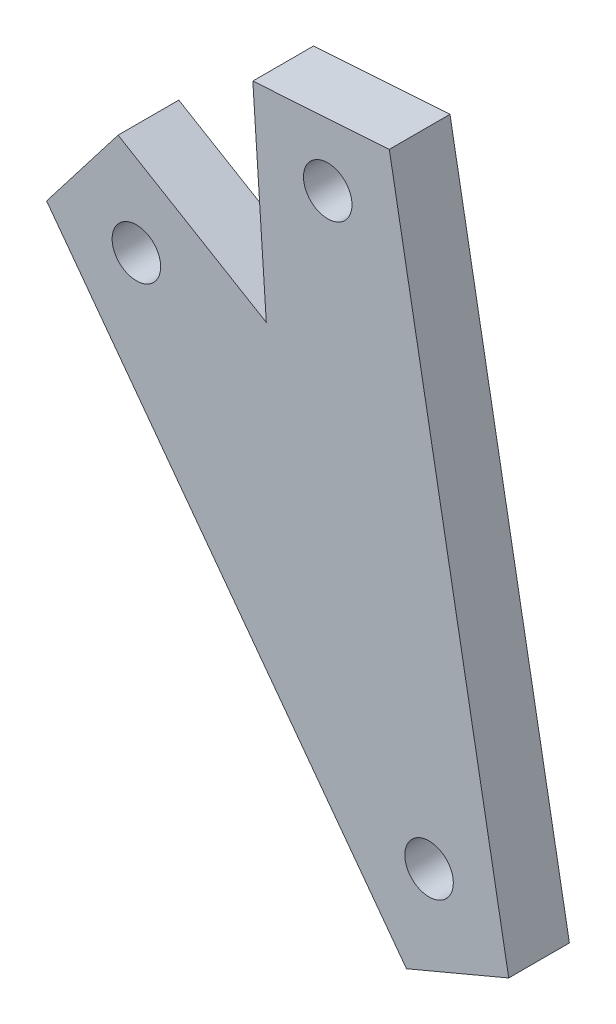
ISO-10303-21;
HEADER;
FILE_DESCRIPTION(('STEP AP214'),'2;1');
FILE_NAME('part.step','',(''),(''),'','','');
FILE_SCHEMA(('AUTOMOTIVE_DESIGN { 1 0 10303 214 1 1 1 1 }'));
ENDSEC;
DATA;
#1=APPLICATION_CONTEXT('core data for automotive mechanical design processes');
#2=APPLICATION_PROTOCOL_DEFINITION('international standard','automotive_design',2000,#1);
#3=PRODUCT_CONTEXT('',#1,'mechanical');
#4=PRODUCT('Part','Part','',(#3));
#5=PRODUCT_RELATED_PRODUCT_CATEGORY('part','',(#4));
#6=PRODUCT_DEFINITION_FORMATION('','',#4);
#7=PRODUCT_DEFINITION_CONTEXT('part definition',#1,'design');
#8=PRODUCT_DEFINITION('design','',#6,#7);
#9=PRODUCT_DEFINITION_SHAPE('','',#8);
#10=(LENGTH_UNIT() NAMED_UNIT(*) SI_UNIT(.MILLI.,.METRE.));
#11=(NAMED_UNIT(*) PLANE_ANGLE_UNIT() SI_UNIT($,.RADIAN.));
#12=(NAMED_UNIT(*) SI_UNIT($,.STERADIAN.) SOLID_ANGLE_UNIT());
#13=UNCERTAINTY_MEASURE_WITH_UNIT(LENGTH_MEASURE(1.E-05),#10,'distance_accuracy_value','');
#14=(GEOMETRIC_REPRESENTATION_CONTEXT(3) GLOBAL_UNCERTAINTY_ASSIGNED_CONTEXT((#13)) GLOBAL_UNIT_ASSIGNED_CONTEXT((#10,
#11,#12)) REPRESENTATION_CONTEXT('',''));
#15=CARTESIAN_POINT('',(0.,0.,0.));
#16=DIRECTION('',(0.,0.,1.));
#17=DIRECTION('',(1.,0.,0.));
#18=AXIS2_PLACEMENT_3D('',#15,#16,#17);
#19=CARTESIAN_POINT('',(0.,0.,6.35));
#20=DIRECTION('',(0.,0.,-1.));
#21=DIRECTION('',(-1.,0.,0.));
#22=AXIS2_PLACEMENT_3D('',#19,#20,#21);
#23=PLANE('',#22);
#24=CARTESIAN_POINT('',(-30.6283624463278,40.5283038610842,6.35));
#25=DIRECTION('',(0.,0.,1.));
#26=DIRECTION('',(1.,0.,0.));
#27=AXIS2_PLACEMENT_3D('',#24,#25,#26);
#28=CIRCLE('',#27,2.54);
#29=CARTESIAN_POINT('',(-28.0883624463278,40.5283038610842,6.35));
#30=VERTEX_POINT('',#29);
#31=EDGE_CURVE('E164',#30,#30,#28,.T.);
#32=ORIENTED_EDGE('',*,*,#31,.F.);
#33=EDGE_LOOP('',(#32));
#34=FACE_BOUND('',#33,.T.);
#35=DIRECTION('',(-0.610620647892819,-0.791923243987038,0.));
#36=VECTOR('',#35,1.);
#37=CARTESIAN_POINT('',(-32.5418459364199,50.234477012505,6.35));
#38=LINE('',#37,#36);
#39=CARTESIAN_POINT('',(-32.5418459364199,50.234477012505,6.35));
#40=VERTEX_POINT('',#39);
#41=CARTESIAN_POINT('',(-40.0258916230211,40.5283038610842,6.35));
#42=VERTEX_POINT('',#41);
#43=EDGE_CURVE('E137',#40,#42,#38,.T.);
#44=ORIENTED_EDGE('',*,*,#43,.T.);
#45=DIRECTION('',(0.595876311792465,-0.803076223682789,0.));
#46=VECTOR('',#45,1.);
#47=CARTESIAN_POINT('',(-40.0258916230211,40.5283038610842,6.35));
#48=LINE('',#47,#46);
#49=CARTESIAN_POINT('',(-2.36193193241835,-10.2322817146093,6.35));
#50=VERTEX_POINT('',#49);
#51=EDGE_CURVE('E90',#42,#50,#48,.T.);
#52=ORIENTED_EDGE('',*,*,#51,.T.);
#53=DIRECTION('',(0.921374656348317,0.388675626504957,0.));
#54=VECTOR('',#53,1.);
#55=CARTESIAN_POINT('',(-2.36193193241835,-10.2322817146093,6.35));
#56=LINE('',#55,#54);
#57=CARTESIAN_POINT('',(8.33836303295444,-5.71843512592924,6.35));
#58=VERTEX_POINT('',#57);
#59=EDGE_CURVE('E149',#50,#58,#56,.T.);
#60=ORIENTED_EDGE('',*,*,#59,.T.);
#61=DIRECTION('',(-0.178582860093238,0.983924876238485,0.));
#62=VECTOR('',#61,1.);
#63=CARTESIAN_POINT('',(8.33836303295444,-5.71843512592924,6.35));
#64=LINE('',#63,#62);
#65=CARTESIAN_POINT('',(-4.1590904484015,63.1378670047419,6.35));
#66=VERTEX_POINT('',#65);
#67=EDGE_CURVE('E106',#58,#66,#64,.T.);
#68=ORIENTED_EDGE('',*,*,#67,.T.);
#69=DIRECTION('',(-0.997791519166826,-0.0664235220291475,0.));
#70=VECTOR('',#69,1.);
#71=CARTESIAN_POINT('',(-4.1590904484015,63.1378670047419,6.35));
#72=LINE('',#71,#70);
#73=CARTESIAN_POINT('',(-18.442322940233,62.1870244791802,6.35));
#74=VERTEX_POINT('',#73);
#75=EDGE_CURVE('E100',#66,#74,#72,.T.);
#76=ORIENTED_EDGE('',*,*,#75,.T.);
#77=DIRECTION('',(0.0664235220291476,-0.997791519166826,0.));
#78=VECTOR('',#77,1.);
#79=CARTESIAN_POINT('',(-18.442322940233,62.1870244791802,6.35));
#80=LINE('',#79,#78);
#81=CARTESIAN_POINT('',(-17.0326458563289,41.0113355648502,6.35));
#82=VERTEX_POINT('',#81);
#83=EDGE_CURVE('E104',#74,#82,#80,.T.);
#84=ORIENTED_EDGE('',*,*,#83,.T.);
#85=DIRECTION('',(-0.859500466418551,0.511134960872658,0.));
#86=VECTOR('',#85,1.);
#87=CARTESIAN_POINT('',(-17.0326458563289,41.0113355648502,6.35));
#88=LINE('',#87,#86);
#89=EDGE_CURVE('E50',#82,#40,#88,.T.);
#90=ORIENTED_EDGE('',*,*,#89,.T.);
#91=EDGE_LOOP('',(#44,#52,#60,#68,#76,#84,#90));
#92=FACE_BOUND('',#91,.T.);
#93=CARTESIAN_POINT('',(-10.6059683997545,56.1572429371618,6.35));
#94=DIRECTION('',(0.,0.,1.));
#95=DIRECTION('',(1.,0.,0.));
#96=AXIS2_PLACEMENT_3D('',#93,#94,#95);
#97=CIRCLE('',#96,2.54);
#98=CARTESIAN_POINT('',(-8.06596839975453,56.1572429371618,6.35));
#99=VERTEX_POINT('',#98);
#100=EDGE_CURVE('E128',#99,#99,#97,.T.);
#101=ORIENTED_EDGE('',*,*,#100,.F.);
#102=EDGE_LOOP('',(#101));
#103=FACE_BOUND('',#102,.T.);
#104=CARTESIAN_POINT('',(0.,0.,6.35));
#105=DIRECTION('',(0.,0.,1.));
#106=DIRECTION('',(1.,0.,0.));
#107=AXIS2_PLACEMENT_3D('',#104,#105,#106);
#108=CIRCLE('',#107,2.54);
#109=CARTESIAN_POINT('',(2.54,0.,6.35));
#110=VERTEX_POINT('',#109);
#111=EDGE_CURVE('E170',#110,#110,#108,.T.);
#112=ORIENTED_EDGE('',*,*,#111,.F.);
#113=EDGE_LOOP('',(#112));
#114=FACE_BOUND('',#113,.T.);
#115=ADVANCED_FACE('F33',(#34,#92,#103,#114),#23,.F.);
#116=CARTESIAN_POINT('',(0.,0.,0.));
#117=DIRECTION('',(0.,0.,-1.));
#118=DIRECTION('',(-1.,0.,0.));
#119=AXIS2_PLACEMENT_3D('',#116,#117,#118);
#120=PLANE('',#119);
#121=CARTESIAN_POINT('',(-30.6283624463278,40.5283038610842,0.));
#122=DIRECTION('',(0.,0.,1.));
#123=DIRECTION('',(1.,0.,0.));
#124=AXIS2_PLACEMENT_3D('',#121,#122,#123);
#125=CIRCLE('',#124,2.54);
#126=CARTESIAN_POINT('',(-28.0883624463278,40.5283038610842,0.));
#127=VERTEX_POINT('',#126);
#128=EDGE_CURVE('E167',#127,#127,#125,.T.);
#129=ORIENTED_EDGE('',*,*,#128,.T.);
#130=EDGE_LOOP('',(#129));
#131=FACE_BOUND('',#130,.T.);
#132=DIRECTION('',(-0.610620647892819,-0.791923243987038,0.));
#133=VECTOR('',#132,1.);
#134=CARTESIAN_POINT('',(-32.5418459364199,50.234477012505,0.));
#135=LINE('',#134,#133);
#136=CARTESIAN_POINT('',(-32.5418459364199,50.234477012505,0.));
#137=VERTEX_POINT('',#136);
#138=CARTESIAN_POINT('',(-40.0258916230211,40.5283038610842,0.));
#139=VERTEX_POINT('',#138);
#140=EDGE_CURVE('E124',#137,#139,#135,.T.);
#141=ORIENTED_EDGE('',*,*,#140,.F.);
#142=DIRECTION('',(-0.859500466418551,0.511134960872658,0.));
#143=VECTOR('',#142,1.);
#144=CARTESIAN_POINT('',(-17.0326458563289,41.0113355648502,0.));
#145=LINE('',#144,#143);
#146=CARTESIAN_POINT('',(-17.0326458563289,41.0113355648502,0.));
#147=VERTEX_POINT('',#146);
#148=EDGE_CURVE('E82',#147,#137,#145,.T.);
#149=ORIENTED_EDGE('',*,*,#148,.F.);
#150=DIRECTION('',(0.0664235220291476,-0.997791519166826,0.));
#151=VECTOR('',#150,1.);
#152=CARTESIAN_POINT('',(-18.442322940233,62.1870244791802,0.));
#153=LINE('',#152,#151);
#154=CARTESIAN_POINT('',(-18.442322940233,62.1870244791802,0.));
#155=VERTEX_POINT('',#154);
#156=EDGE_CURVE('E76',#155,#147,#153,.T.);
#157=ORIENTED_EDGE('',*,*,#156,.F.);
#158=DIRECTION('',(-0.997791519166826,-0.0664235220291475,0.));
#159=VECTOR('',#158,1.);
#160=CARTESIAN_POINT('',(-4.1590904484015,63.1378670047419,0.));
#161=LINE('',#160,#159);
#162=CARTESIAN_POINT('',(-4.1590904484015,63.1378670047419,0.));
#163=VERTEX_POINT('',#162);
#164=EDGE_CURVE('E114',#163,#155,#161,.T.);
#165=ORIENTED_EDGE('',*,*,#164,.F.);
#166=DIRECTION('',(-0.178582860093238,0.983924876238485,0.));
#167=VECTOR('',#166,1.);
#168=CARTESIAN_POINT('',(8.33836303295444,-5.71843512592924,0.));
#169=LINE('',#168,#167);
#170=CARTESIAN_POINT('',(8.33836303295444,-5.71843512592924,0.));
#171=VERTEX_POINT('',#170);
#172=EDGE_CURVE('E132',#171,#163,#169,.T.);
#173=ORIENTED_EDGE('',*,*,#172,.F.);
#174=DIRECTION('',(0.921374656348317,0.388675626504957,0.));
#175=VECTOR('',#174,1.);
#176=CARTESIAN_POINT('',(-2.36193193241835,-10.2322817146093,0.));
#177=LINE('',#176,#175);
#178=CARTESIAN_POINT('',(-2.36193193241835,-10.2322817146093,0.));
#179=VERTEX_POINT('',#178);
#180=EDGE_CURVE('E130',#179,#171,#177,.T.);
#181=ORIENTED_EDGE('',*,*,#180,.F.);
#182=DIRECTION('',(0.595876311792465,-0.803076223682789,0.));
#183=VECTOR('',#182,1.);
#184=CARTESIAN_POINT('',(-40.0258916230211,40.5283038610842,0.));
#185=LINE('',#184,#183);
#186=EDGE_CURVE('E127',#139,#179,#185,.T.);
#187=ORIENTED_EDGE('',*,*,#186,.F.);
#188=EDGE_LOOP('',(#141,#149,#157,#165,#173,#181,#187));
#189=FACE_BOUND('',#188,.T.);
#190=CARTESIAN_POINT('',(-10.6059683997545,56.1572429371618,0.));
#191=DIRECTION('',(0.,0.,1.));
#192=DIRECTION('',(1.,0.,0.));
#193=AXIS2_PLACEMENT_3D('',#190,#191,#192);
#194=CIRCLE('',#193,2.54);
#195=CARTESIAN_POINT('',(-8.06596839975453,56.1572429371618,0.));
#196=VERTEX_POINT('',#195);
#197=EDGE_CURVE('E161',#196,#196,#194,.T.);
#198=ORIENTED_EDGE('',*,*,#197,.T.);
#199=EDGE_LOOP('',(#198));
#200=FACE_BOUND('',#199,.T.);
#201=CARTESIAN_POINT('',(0.,0.,0.));
#202=DIRECTION('',(0.,0.,1.));
#203=DIRECTION('',(1.,0.,0.));
#204=AXIS2_PLACEMENT_3D('',#201,#202,#203);
#205=CIRCLE('',#204,2.54);
#206=CARTESIAN_POINT('',(2.54,0.,0.));
#207=VERTEX_POINT('',#206);
#208=EDGE_CURVE('E173',#207,#207,#205,.T.);
#209=ORIENTED_EDGE('',*,*,#208,.T.);
#210=EDGE_LOOP('',(#209));
#211=FACE_BOUND('',#210,.T.);
#212=ADVANCED_FACE('F153',(#131,#189,#200,#211),#120,.T.);
#213=CARTESIAN_POINT('',(-32.5418459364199,50.234477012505,6.35));
#214=DIRECTION('',(0.791923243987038,-0.610620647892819,0.));
#215=DIRECTION('',(0.610620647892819,0.791923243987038,0.));
#216=AXIS2_PLACEMENT_3D('',#213,#214,#215);
#217=PLANE('',#216);
#218=ORIENTED_EDGE('',*,*,#140,.T.);
#219=DIRECTION('',(0.,0.,-1.));
#220=VECTOR('',#219,1.);
#221=CARTESIAN_POINT('',(-40.0258916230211,40.5283038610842,6.35));
#222=LINE('',#221,#220);
#223=EDGE_CURVE('E11',#42,#139,#222,.T.);
#224=ORIENTED_EDGE('',*,*,#223,.F.);
#225=ORIENTED_EDGE('',*,*,#43,.F.);
#226=DIRECTION('',(0.,0.,-1.));
#227=VECTOR('',#226,1.);
#228=CARTESIAN_POINT('',(-32.5418459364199,50.234477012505,6.35));
#229=LINE('',#228,#227);
#230=EDGE_CURVE('E120',#40,#137,#229,.T.);
#231=ORIENTED_EDGE('',*,*,#230,.T.);
#232=EDGE_LOOP('',(#218,#224,#225,#231));
#233=FACE_BOUND('',#232,.T.);
#234=ADVANCED_FACE('F35',(#233),#217,.F.);
#235=CARTESIAN_POINT('',(-40.0258916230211,40.5283038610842,6.35));
#236=DIRECTION('',(0.803076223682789,0.595876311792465,0.));
#237=DIRECTION('',(-0.595876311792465,0.803076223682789,0.));
#238=AXIS2_PLACEMENT_3D('',#235,#236,#237);
#239=PLANE('',#238);
#240=ORIENTED_EDGE('',*,*,#186,.T.);
#241=DIRECTION('',(0.,0.,-1.));
#242=VECTOR('',#241,1.);
#243=CARTESIAN_POINT('',(-2.36193193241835,-10.2322817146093,6.35));
#244=LINE('',#243,#242);
#245=EDGE_CURVE('E42',#50,#179,#244,.T.);
#246=ORIENTED_EDGE('',*,*,#245,.F.);
#247=ORIENTED_EDGE('',*,*,#51,.F.);
#248=ORIENTED_EDGE('',*,*,#223,.T.);
#249=EDGE_LOOP('',(#240,#246,#247,#248));
#250=FACE_BOUND('',#249,.T.);
#251=ADVANCED_FACE('F205',(#250),#239,.F.);
#252=CARTESIAN_POINT('',(-2.36193193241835,-10.2322817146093,6.35));
#253=DIRECTION('',(-0.388675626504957,0.921374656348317,0.));
#254=DIRECTION('',(-0.921374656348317,-0.388675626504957,0.));
#255=AXIS2_PLACEMENT_3D('',#252,#253,#254);
#256=PLANE('',#255);
#257=ORIENTED_EDGE('',*,*,#180,.T.);
#258=DIRECTION('',(0.,0.,-1.));
#259=VECTOR('',#258,1.);
#260=CARTESIAN_POINT('',(8.33836303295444,-5.71843512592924,6.35));
#261=LINE('',#260,#259);
#262=EDGE_CURVE('E141',#58,#171,#261,.T.);
#263=ORIENTED_EDGE('',*,*,#262,.F.);
#264=ORIENTED_EDGE('',*,*,#59,.F.);
#265=ORIENTED_EDGE('',*,*,#245,.T.);
#266=EDGE_LOOP('',(#257,#263,#264,#265));
#267=FACE_BOUND('',#266,.T.);
#268=ADVANCED_FACE('F147',(#267),#256,.F.);
#269=CARTESIAN_POINT('',(8.33836303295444,-5.71843512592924,6.35));
#270=DIRECTION('',(-0.983924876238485,-0.178582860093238,0.));
#271=DIRECTION('',(0.178582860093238,-0.983924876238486,0.));
#272=AXIS2_PLACEMENT_3D('',#269,#270,#271);
#273=PLANE('',#272);
#274=ORIENTED_EDGE('',*,*,#172,.T.);
#275=DIRECTION('',(0.,0.,-1.));
#276=VECTOR('',#275,1.);
#277=CARTESIAN_POINT('',(-4.1590904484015,63.1378670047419,6.35));
#278=LINE('',#277,#276);
#279=EDGE_CURVE('E115',#66,#163,#278,.T.);
#280=ORIENTED_EDGE('',*,*,#279,.F.);
#281=ORIENTED_EDGE('',*,*,#67,.F.);
#282=ORIENTED_EDGE('',*,*,#262,.T.);
#283=EDGE_LOOP('',(#274,#280,#281,#282));
#284=FACE_BOUND('',#283,.T.);
#285=ADVANCED_FACE('F156',(#284),#273,.F.);
#286=CARTESIAN_POINT('',(-4.1590904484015,63.1378670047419,6.35));
#287=DIRECTION('',(0.0664235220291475,-0.997791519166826,0.));
#288=DIRECTION('',(0.997791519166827,0.0664235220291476,0.));
#289=AXIS2_PLACEMENT_3D('',#286,#287,#288);
#290=PLANE('',#289);
#291=ORIENTED_EDGE('',*,*,#164,.T.);
#292=DIRECTION('',(0.,0.,-1.));
#293=VECTOR('',#292,1.);
#294=CARTESIAN_POINT('',(-18.442322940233,62.1870244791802,6.35));
#295=LINE('',#294,#293);
#296=EDGE_CURVE('E111',#74,#155,#295,.T.);
#297=ORIENTED_EDGE('',*,*,#296,.F.);
#298=ORIENTED_EDGE('',*,*,#75,.F.);
#299=ORIENTED_EDGE('',*,*,#279,.T.);
#300=EDGE_LOOP('',(#291,#297,#298,#299));
#301=FACE_BOUND('',#300,.T.);
#302=ADVANCED_FACE('F112',(#301),#290,.F.);
#303=CARTESIAN_POINT('',(-18.442322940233,62.1870244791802,6.35));
#304=DIRECTION('',(0.997791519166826,0.0664235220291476,0.));
#305=DIRECTION('',(-0.0664235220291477,0.997791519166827,0.));
#306=AXIS2_PLACEMENT_3D('',#303,#304,#305);
#307=PLANE('',#306);
#308=ORIENTED_EDGE('',*,*,#156,.T.);
#309=DIRECTION('',(0.,0.,-1.));
#310=VECTOR('',#309,1.);
#311=CARTESIAN_POINT('',(-17.0326458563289,41.0113355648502,6.35));
#312=LINE('',#311,#310);
#313=EDGE_CURVE('E116',#82,#147,#312,.T.);
#314=ORIENTED_EDGE('',*,*,#313,.F.);
#315=ORIENTED_EDGE('',*,*,#83,.F.);
#316=ORIENTED_EDGE('',*,*,#296,.T.);
#317=EDGE_LOOP('',(#308,#314,#315,#316));
#318=FACE_BOUND('',#317,.T.);
#319=ADVANCED_FACE('F118',(#318),#307,.F.);
#320=CARTESIAN_POINT('',(-17.0326458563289,41.0113355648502,6.35));
#321=DIRECTION('',(-0.511134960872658,-0.859500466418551,0.));
#322=DIRECTION('',(0.859500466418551,-0.511134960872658,0.));
#323=AXIS2_PLACEMENT_3D('',#320,#321,#322);
#324=PLANE('',#323);
#325=ORIENTED_EDGE('',*,*,#148,.T.);
#326=ORIENTED_EDGE('',*,*,#230,.F.);
#327=ORIENTED_EDGE('',*,*,#89,.F.);
#328=ORIENTED_EDGE('',*,*,#313,.T.);
#329=EDGE_LOOP('',(#325,#326,#327,#328));
#330=FACE_BOUND('',#329,.T.);
#331=ADVANCED_FACE('F195',(#330),#324,.F.);
#332=CARTESIAN_POINT('',(-10.6059683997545,56.1572429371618,6.35));
#333=DIRECTION('',(0.,0.,-1.));
#334=DIRECTION('',(-1.,0.,0.));
#335=AXIS2_PLACEMENT_3D('',#332,#333,#334);
#336=CYLINDRICAL_SURFACE('',#335,2.54);
#337=ORIENTED_EDGE('',*,*,#100,.T.);
#338=EDGE_LOOP('',(#337));
#339=FACE_BOUND('',#338,.T.);
#340=ORIENTED_EDGE('',*,*,#197,.F.);
#341=EDGE_LOOP('',(#340));
#342=FACE_BOUND('',#341,.T.);
#343=ADVANCED_FACE('F192',(#339,#342),#336,.F.);
#344=CARTESIAN_POINT('',(-30.6283624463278,40.5283038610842,6.35));
#345=DIRECTION('',(0.,0.,-1.));
#346=DIRECTION('',(-1.,0.,0.));
#347=AXIS2_PLACEMENT_3D('',#344,#345,#346);
#348=CYLINDRICAL_SURFACE('',#347,2.54);
#349=ORIENTED_EDGE('',*,*,#31,.T.);
#350=EDGE_LOOP('',(#349));
#351=FACE_BOUND('',#350,.T.);
#352=ORIENTED_EDGE('',*,*,#128,.F.);
#353=EDGE_LOOP('',(#352));
#354=FACE_BOUND('',#353,.T.);
#355=ADVANCED_FACE('F264',(#351,#354),#348,.F.);
#356=CARTESIAN_POINT('',(0.,0.,6.35));
#357=DIRECTION('',(0.,0.,-1.));
#358=DIRECTION('',(-1.,0.,0.));
#359=AXIS2_PLACEMENT_3D('',#356,#357,#358);
#360=CYLINDRICAL_SURFACE('',#359,2.54);
#361=ORIENTED_EDGE('',*,*,#111,.T.);
#362=EDGE_LOOP('',(#361));
#363=FACE_BOUND('',#362,.T.);
#364=ORIENTED_EDGE('',*,*,#208,.F.);
#365=EDGE_LOOP('',(#364));
#366=FACE_BOUND('',#365,.T.);
#367=ADVANCED_FACE('F179',(#363,#366),#360,.F.);
#368=CLOSED_SHELL('',(#115,#212,#234,#251,#268,#285,#302,#319,#331,#343,#355,#367));
#369=MANIFOLD_SOLID_BREP('B2',#368);
#370=ADVANCED_BREP_SHAPE_REPRESENTATION('',(#18,#369),#14);
#371=SHAPE_DEFINITION_REPRESENTATION(#9,#370);
ENDSEC;
END-ISO-10303-21;
